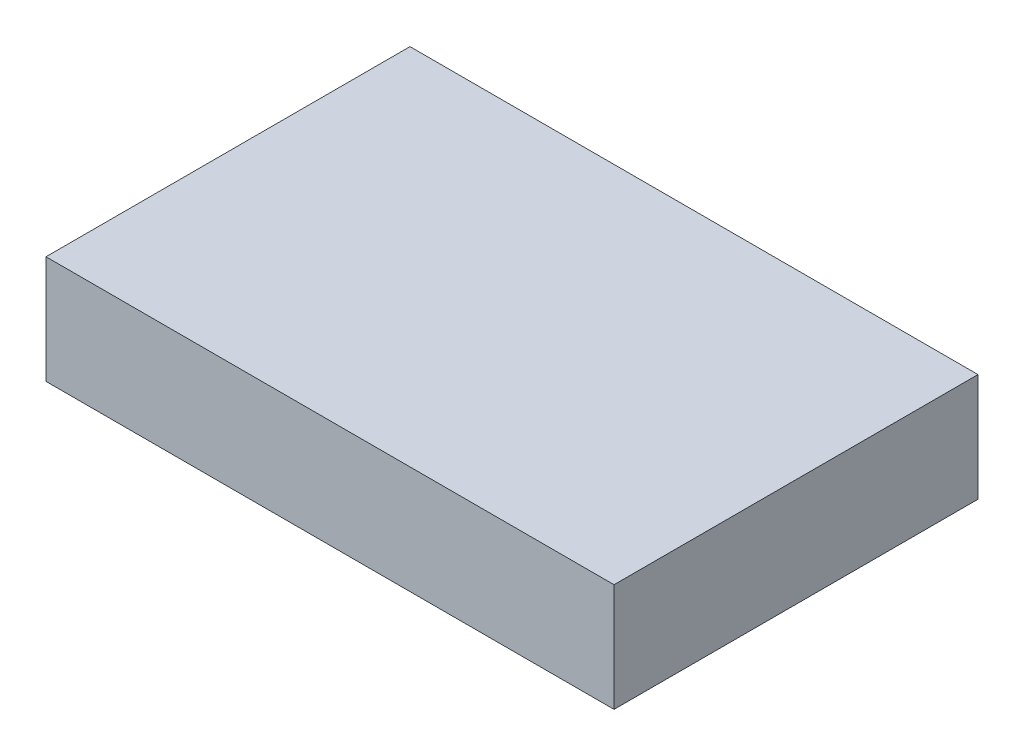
ISO-10303-21;
HEADER;
FILE_DESCRIPTION(('STEP AP214'),'2;1');
FILE_NAME('part.step','',(''),(''),'','','');
FILE_SCHEMA(('AUTOMOTIVE_DESIGN { 1 0 10303 214 1 1 1 1 }'));
ENDSEC;
DATA;
#1=APPLICATION_CONTEXT('core data for automotive mechanical design processes');
#2=APPLICATION_PROTOCOL_DEFINITION('international standard','automotive_design',2000,#1);
#3=PRODUCT_CONTEXT('',#1,'mechanical');
#4=PRODUCT('Part','Part','',(#3));
#5=PRODUCT_RELATED_PRODUCT_CATEGORY('part','',(#4));
#6=PRODUCT_DEFINITION_FORMATION('','',#4);
#7=PRODUCT_DEFINITION_CONTEXT('part definition',#1,'design');
#8=PRODUCT_DEFINITION('design','',#6,#7);
#9=PRODUCT_DEFINITION_SHAPE('','',#8);
#10=(LENGTH_UNIT() NAMED_UNIT(*) SI_UNIT(.MILLI.,.METRE.));
#11=(NAMED_UNIT(*) PLANE_ANGLE_UNIT() SI_UNIT($,.RADIAN.));
#12=(NAMED_UNIT(*) SI_UNIT($,.STERADIAN.) SOLID_ANGLE_UNIT());
#13=UNCERTAINTY_MEASURE_WITH_UNIT(LENGTH_MEASURE(1.E-05),#10,'distance_accuracy_value','');
#14=(GEOMETRIC_REPRESENTATION_CONTEXT(3) GLOBAL_UNCERTAINTY_ASSIGNED_CONTEXT((#13)) GLOBAL_UNIT_ASSIGNED_CONTEXT((#10,
#11,#12)) REPRESENTATION_CONTEXT('',''));
#15=CARTESIAN_POINT('',(0.,0.,0.));
#16=DIRECTION('',(0.,0.,1.));
#17=DIRECTION('',(1.,0.,0.));
#18=AXIS2_PLACEMENT_3D('',#15,#16,#17);
#19=CARTESIAN_POINT('',(-86.7956107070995,33.,-55.6146576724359));
#20=DIRECTION('',(1.,0.,0.));
#21=DIRECTION('',(0.,0.,-1.));
#22=AXIS2_PLACEMENT_3D('',#19,#20,#21);
#23=PLANE('',#22);
#24=DIRECTION('',(0.,0.,1.));
#25=VECTOR('',#24,1.);
#26=CARTESIAN_POINT('',(-86.7956107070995,0.,-55.6146576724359));
#27=LINE('',#26,#25);
#28=CARTESIAN_POINT('',(-86.7956107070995,0.,-55.6146576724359));
#29=VERTEX_POINT('',#28);
#30=CARTESIAN_POINT('',(-86.7956107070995,0.,55.6146576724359));
#31=VERTEX_POINT('',#30);
#32=EDGE_CURVE('E75',#29,#31,#27,.T.);
#33=ORIENTED_EDGE('',*,*,#32,.T.);
#34=DIRECTION('',(0.,-1.,0.));
#35=VECTOR('',#34,1.);
#36=CARTESIAN_POINT('',(-86.7956107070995,33.,55.6146576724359));
#37=LINE('',#36,#35);
#38=CARTESIAN_POINT('',(-86.7956107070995,33.,55.6146576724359));
#39=VERTEX_POINT('',#38);
#40=EDGE_CURVE('E11',#39,#31,#37,.T.);
#41=ORIENTED_EDGE('',*,*,#40,.F.);
#42=DIRECTION('',(0.,0.,1.));
#43=VECTOR('',#42,1.);
#44=CARTESIAN_POINT('',(-86.7956107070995,33.,-55.6146576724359));
#45=LINE('',#44,#43);
#46=CARTESIAN_POINT('',(-86.7956107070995,33.,-55.6146576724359));
#47=VERTEX_POINT('',#46);
#48=EDGE_CURVE('E93',#47,#39,#45,.T.);
#49=ORIENTED_EDGE('',*,*,#48,.F.);
#50=DIRECTION('',(0.,-1.,0.));
#51=VECTOR('',#50,1.);
#52=CARTESIAN_POINT('',(-86.7956107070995,33.,-55.6146576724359));
#53=LINE('',#52,#51);
#54=EDGE_CURVE('E87',#47,#29,#53,.T.);
#55=ORIENTED_EDGE('',*,*,#54,.T.);
#56=EDGE_LOOP('',(#33,#41,#49,#55));
#57=FACE_BOUND('',#56,.T.);
#58=ADVANCED_FACE('F31',(#57),#23,.F.);
#59=CARTESIAN_POINT('',(-86.7956107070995,33.,55.6146576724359));
#60=DIRECTION('',(0.,0.,-1.));
#61=DIRECTION('',(-1.,0.,0.));
#62=AXIS2_PLACEMENT_3D('',#59,#60,#61);
#63=PLANE('',#62);
#64=DIRECTION('',(1.,0.,0.));
#65=VECTOR('',#64,1.);
#66=CARTESIAN_POINT('',(-86.7956107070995,0.,55.6146576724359));
#67=LINE('',#66,#65);
#68=CARTESIAN_POINT('',(86.7956107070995,0.,55.6146576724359));
#69=VERTEX_POINT('',#68);
#70=EDGE_CURVE('E71',#31,#69,#67,.T.);
#71=ORIENTED_EDGE('',*,*,#70,.T.);
#72=DIRECTION('',(0.,-1.,0.));
#73=VECTOR('',#72,1.);
#74=CARTESIAN_POINT('',(86.7956107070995,33.,55.6146576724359));
#75=LINE('',#74,#73);
#76=CARTESIAN_POINT('',(86.7956107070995,33.,55.6146576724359));
#77=VERTEX_POINT('',#76);
#78=EDGE_CURVE('E38',#77,#69,#75,.T.);
#79=ORIENTED_EDGE('',*,*,#78,.F.);
#80=DIRECTION('',(1.,0.,0.));
#81=VECTOR('',#80,1.);
#82=CARTESIAN_POINT('',(-86.7956107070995,33.,55.6146576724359));
#83=LINE('',#82,#81);
#84=EDGE_CURVE('E83',#39,#77,#83,.T.);
#85=ORIENTED_EDGE('',*,*,#84,.F.);
#86=ORIENTED_EDGE('',*,*,#40,.T.);
#87=EDGE_LOOP('',(#71,#79,#85,#86));
#88=FACE_BOUND('',#87,.T.);
#89=ADVANCED_FACE('F82',(#88),#63,.F.);
#90=CARTESIAN_POINT('',(86.7956107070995,33.,-55.6146576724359));
#91=DIRECTION('',(-1.,0.,0.));
#92=DIRECTION('',(0.,0.,1.));
#93=AXIS2_PLACEMENT_3D('',#90,#91,#92);
#94=PLANE('',#93);
#95=DIRECTION('',(0.,0.,-1.));
#96=VECTOR('',#95,1.);
#97=CARTESIAN_POINT('',(86.7956107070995,0.,-55.6146576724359));
#98=LINE('',#97,#96);
#99=CARTESIAN_POINT('',(86.7956107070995,0.,-55.6146576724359));
#100=VERTEX_POINT('',#99);
#101=EDGE_CURVE('E76',#69,#100,#98,.T.);
#102=ORIENTED_EDGE('',*,*,#101,.T.);
#103=DIRECTION('',(0.,-1.,0.));
#104=VECTOR('',#103,1.);
#105=CARTESIAN_POINT('',(86.7956107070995,33.,-55.6146576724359));
#106=LINE('',#105,#104);
#107=CARTESIAN_POINT('',(86.7956107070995,33.,-55.6146576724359));
#108=VERTEX_POINT('',#107);
#109=EDGE_CURVE('E99',#108,#100,#106,.T.);
#110=ORIENTED_EDGE('',*,*,#109,.F.);
#111=DIRECTION('',(0.,0.,-1.));
#112=VECTOR('',#111,1.);
#113=CARTESIAN_POINT('',(86.7956107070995,33.,-55.6146576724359));
#114=LINE('',#113,#112);
#115=EDGE_CURVE('E50',#77,#108,#114,.T.);
#116=ORIENTED_EDGE('',*,*,#115,.F.);
#117=ORIENTED_EDGE('',*,*,#78,.T.);
#118=EDGE_LOOP('',(#102,#110,#116,#117));
#119=FACE_BOUND('',#118,.T.);
#120=ADVANCED_FACE('F102',(#119),#94,.F.);
#121=CARTESIAN_POINT('',(-86.7956107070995,33.,-55.6146576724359));
#122=DIRECTION('',(0.,0.,1.));
#123=DIRECTION('',(1.,0.,0.));
#124=AXIS2_PLACEMENT_3D('',#121,#122,#123);
#125=PLANE('',#124);
#126=DIRECTION('',(-1.,0.,0.));
#127=VECTOR('',#126,1.);
#128=CARTESIAN_POINT('',(-86.7956107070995,0.,-55.6146576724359));
#129=LINE('',#128,#127);
#130=EDGE_CURVE('E91',#100,#29,#129,.T.);
#131=ORIENTED_EDGE('',*,*,#130,.T.);
#132=ORIENTED_EDGE('',*,*,#54,.F.);
#133=DIRECTION('',(-1.,0.,0.));
#134=VECTOR('',#133,1.);
#135=CARTESIAN_POINT('',(-86.7956107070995,33.,-55.6146576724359));
#136=LINE('',#135,#134);
#137=EDGE_CURVE('E45',#108,#47,#136,.T.);
#138=ORIENTED_EDGE('',*,*,#137,.F.);
#139=ORIENTED_EDGE('',*,*,#109,.T.);
#140=EDGE_LOOP('',(#131,#132,#138,#139));
#141=FACE_BOUND('',#140,.T.);
#142=ADVANCED_FACE('F104',(#141),#125,.F.);
#143=CARTESIAN_POINT('',(-86.7956107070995,33.,55.6146576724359));
#144=DIRECTION('',(0.,1.,0.));
#145=DIRECTION('',(0.,0.,1.));
#146=AXIS2_PLACEMENT_3D('',#143,#144,#145);
#147=PLANE('',#146);
#148=ORIENTED_EDGE('',*,*,#48,.T.);
#149=ORIENTED_EDGE('',*,*,#84,.T.);
#150=ORIENTED_EDGE('',*,*,#115,.T.);
#151=ORIENTED_EDGE('',*,*,#137,.T.);
#152=EDGE_LOOP('',(#148,#149,#150,#151));
#153=FACE_BOUND('',#152,.T.);
#154=ADVANCED_FACE('F105',(#153),#147,.T.);
#155=CARTESIAN_POINT('',(-86.7956107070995,0.,55.6146576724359));
#156=DIRECTION('',(0.,1.,0.));
#157=DIRECTION('',(0.,0.,1.));
#158=AXIS2_PLACEMENT_3D('',#155,#156,#157);
#159=PLANE('',#158);
#160=ORIENTED_EDGE('',*,*,#32,.F.);
#161=ORIENTED_EDGE('',*,*,#130,.F.);
#162=ORIENTED_EDGE('',*,*,#101,.F.);
#163=ORIENTED_EDGE('',*,*,#70,.F.);
#164=EDGE_LOOP('',(#160,#161,#162,#163));
#165=FACE_BOUND('',#164,.T.);
#166=ADVANCED_FACE('F72',(#165),#159,.F.);
#167=CLOSED_SHELL('',(#58,#89,#120,#142,#154,#166));
#168=MANIFOLD_SOLID_BREP('B2',#167);
#169=ADVANCED_BREP_SHAPE_REPRESENTATION('',(#18,#168),#14);
#170=SHAPE_DEFINITION_REPRESENTATION(#9,#169);
ENDSEC;
END-ISO-10303-21;
